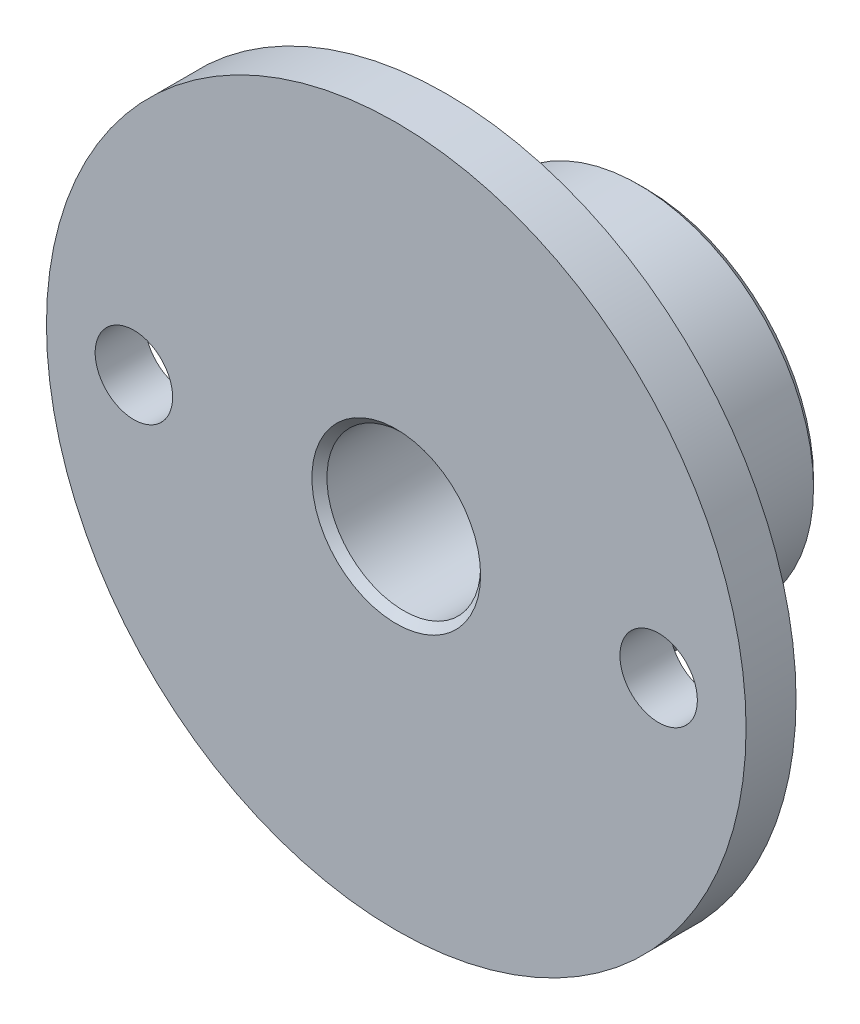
from build123d import *

# Parameters (mm, degrees)
ESQUISSE1_R             = 7
EXTRUSION1_DEPTH        = 8
ESQUISSE2_R             = 14
EXTRUSION2_DEPTH        = 2
ESQUISSE3_R             = 3.075
ENL_V_MAT_EXTRU_1_DEPTH = 23.181073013
ESQUISSE4_R             = 1.55
ENL_V_MAT_EXTRU_2_DEPTH = 23.181073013
ESQUISSE5_R             = 1.25
ENL_V_MAT_EXTRU_3_DEPTH = 10
CHANFREIN1_SIZE         = 0.3


with BuildPart() as part:
    # Esquisse1 → Extrusion1 (new body)
    with BuildSketch(Plane.XY):
        Circle(ESQUISSE1_R)
    extrude(amount=EXTRUSION1_DEPTH)

    # Esquisse2 → Extrusion2 (add)
    with BuildSketch(Plane.XY.offset(8)):
        Circle(ESQUISSE2_R)
    extrude(amount=EXTRUSION2_DEPTH)

    # Esquisse3 → Enl_v. mat.-Extru.1 (cut, through all)
    with BuildSketch(Plane.XY.offset(10)):
        Circle(ESQUISSE3_R)
    extrude(amount=-ENL_V_MAT_EXTRU_1_DEPTH, mode=Mode.SUBTRACT)

    # Esquisse4 → Enl_v. mat.-Extru.2 (cut, through all)
    with BuildSketch(Plane.XY.offset(10)):
        with Locations((-10.5, 0)):
            Circle(ESQUISSE4_R)
        with Locations((10.5, 0)):
            Circle(ESQUISSE4_R)
    extrude(amount=-ENL_V_MAT_EXTRU_2_DEPTH, mode=Mode.SUBTRACT)

    # Esquisse5 → Enl_v. mat.-Extru.3 (cut)
    with BuildSketch(Plane(origin=(0, 0, 0), x_dir=(1, 0, 0), z_dir=(0, 1, 0))):
        with Locations(Location((0, -4, 0), (0, 0, 270))):
            Circle(ESQUISSE5_R)
    extrude(amount=-ENL_V_MAT_EXTRU_3_DEPTH, mode=Mode.SUBTRACT)

    # Chanfrein1
    chanfrein1_edges = [part.edges().sort_by_distance(p)[0] for p in [
        (-3.075, 0, 0),
        (-3.075, 0, 10),
        (-7, 0, 0),
    ]]
    chamfer(chanfrein1_edges, length=CHANFREIN1_SIZE)


solid = part.part
